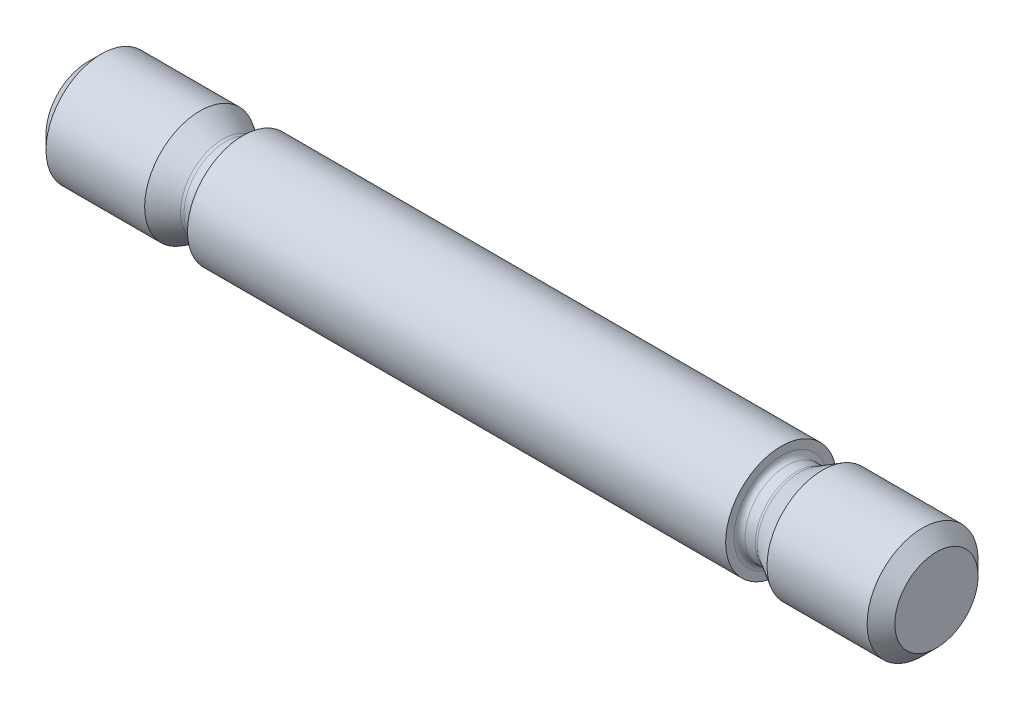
ISO-10303-21;
HEADER;
FILE_DESCRIPTION(('STEP AP214'),'2;1');
FILE_NAME('part.step','',(''),(''),'','','');
FILE_SCHEMA(('AUTOMOTIVE_DESIGN { 1 0 10303 214 1 1 1 1 }'));
ENDSEC;
DATA;
#1=APPLICATION_CONTEXT('core data for automotive mechanical design processes');
#2=APPLICATION_PROTOCOL_DEFINITION('international standard','automotive_design',2000,#1);
#3=PRODUCT_CONTEXT('',#1,'mechanical');
#4=PRODUCT('Part','Part','',(#3));
#5=PRODUCT_RELATED_PRODUCT_CATEGORY('part','',(#4));
#6=PRODUCT_DEFINITION_FORMATION('','',#4);
#7=PRODUCT_DEFINITION_CONTEXT('part definition',#1,'design');
#8=PRODUCT_DEFINITION('design','',#6,#7);
#9=PRODUCT_DEFINITION_SHAPE('','',#8);
#10=(LENGTH_UNIT() NAMED_UNIT(*) SI_UNIT(.MILLI.,.METRE.));
#11=(NAMED_UNIT(*) PLANE_ANGLE_UNIT() SI_UNIT($,.RADIAN.));
#12=(NAMED_UNIT(*) SI_UNIT($,.STERADIAN.) SOLID_ANGLE_UNIT());
#13=UNCERTAINTY_MEASURE_WITH_UNIT(LENGTH_MEASURE(1.E-05),#10,'distance_accuracy_value','');
#14=(GEOMETRIC_REPRESENTATION_CONTEXT(3) GLOBAL_UNCERTAINTY_ASSIGNED_CONTEXT((#13)) GLOBAL_UNIT_ASSIGNED_CONTEXT((#10,
#11,#12)) REPRESENTATION_CONTEXT('',''));
#15=CARTESIAN_POINT('',(0.,0.,0.));
#16=DIRECTION('',(0.,0.,1.));
#17=DIRECTION('',(1.,0.,0.));
#18=AXIS2_PLACEMENT_3D('',#15,#16,#17);
#19=CARTESIAN_POINT('',(0.,6.,0.));
#20=DIRECTION('',(1.,0.,0.));
#21=DIRECTION('',(0.,0.,-1.));
#22=AXIS2_PLACEMENT_3D('',#19,#20,#21);
#23=PLANE('',#22);
#24=CARTESIAN_POINT('',(0.,0.,0.));
#25=DIRECTION('',(-1.,0.,0.));
#26=DIRECTION('',(0.,0.,1.));
#27=AXIS2_PLACEMENT_3D('',#24,#25,#26);
#28=CIRCLE('',#27,6.);
#29=CARTESIAN_POINT('',(0.,0.,6.));
#30=VERTEX_POINT('',#29);
#31=EDGE_CURVE('E83',#30,#30,#28,.T.);
#32=ORIENTED_EDGE('',*,*,#31,.T.);
#33=EDGE_LOOP('',(#32));
#34=FACE_BOUND('',#33,.T.);
#35=ADVANCED_FACE('F31',(#34),#23,.F.);
#36=CARTESIAN_POINT('',(122.4,6.,0.));
#37=DIRECTION('',(1.,0.,0.));
#38=DIRECTION('',(0.,0.,-1.));
#39=AXIS2_PLACEMENT_3D('',#36,#37,#38);
#40=PLANE('',#39);
#41=CARTESIAN_POINT('',(122.4,0.,0.));
#42=DIRECTION('',(-1.,0.,0.));
#43=DIRECTION('',(0.,0.,1.));
#44=AXIS2_PLACEMENT_3D('',#41,#42,#43);
#45=CIRCLE('',#44,6.);
#46=CARTESIAN_POINT('',(122.4,0.,6.));
#47=VERTEX_POINT('',#46);
#48=EDGE_CURVE('E10',#47,#47,#45,.T.);
#49=ORIENTED_EDGE('',*,*,#48,.F.);
#50=EDGE_LOOP('',(#49));
#51=FACE_BOUND('',#50,.T.);
#52=ADVANCED_FACE('F142',(#51),#40,.T.);
#53=CARTESIAN_POINT('',(120.4,0.,0.));
#54=DIRECTION('',(-1.,0.,0.));
#55=DIRECTION('',(0.,0.,1.));
#56=AXIS2_PLACEMENT_3D('',#53,#54,#55);
#57=CONICAL_SURFACE('',#56,8.,0.785398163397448);
#58=ORIENTED_EDGE('',*,*,#48,.T.);
#59=EDGE_LOOP('',(#58));
#60=FACE_BOUND('',#59,.T.);
#61=CARTESIAN_POINT('',(120.4,0.,0.));
#62=DIRECTION('',(-1.,0.,0.));
#63=DIRECTION('',(0.,0.,1.));
#64=AXIS2_PLACEMENT_3D('',#61,#62,#63);
#65=CIRCLE('',#64,8.);
#66=CARTESIAN_POINT('',(120.4,0.,8.));
#67=VERTEX_POINT('',#66);
#68=EDGE_CURVE('E37',#67,#67,#65,.T.);
#69=ORIENTED_EDGE('',*,*,#68,.F.);
#70=EDGE_LOOP('',(#69));
#71=FACE_BOUND('',#70,.T.);
#72=ADVANCED_FACE('F146',(#60,#71),#57,.T.);
#73=CARTESIAN_POINT('',(-3.175,0.,0.));
#74=DIRECTION('',(-1.,0.,0.));
#75=DIRECTION('',(0.,0.,1.));
#76=AXIS2_PLACEMENT_3D('',#73,#74,#75);
#77=CYLINDRICAL_SURFACE('',#76,8.);
#78=ORIENTED_EDGE('',*,*,#68,.T.);
#79=EDGE_LOOP('',(#78));
#80=FACE_BOUND('',#79,.T.);
#81=CARTESIAN_POINT('',(105.964101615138,0.,0.));
#82=DIRECTION('',(-1.,0.,0.));
#83=DIRECTION('',(0.,0.,1.));
#84=AXIS2_PLACEMENT_3D('',#81,#82,#83);
#85=CIRCLE('',#84,8.);
#86=CARTESIAN_POINT('',(105.964101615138,0.,8.));
#87=VERTEX_POINT('',#86);
#88=EDGE_CURVE('E41',#87,#87,#85,.T.);
#89=ORIENTED_EDGE('',*,*,#88,.F.);
#90=EDGE_LOOP('',(#89));
#91=FACE_BOUND('',#90,.T.);
#92=ADVANCED_FACE('F151',(#80,#91),#77,.T.);
#93=CARTESIAN_POINT('',(102.685640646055,0.,0.));
#94=DIRECTION('',(1.,0.,0.));
#95=DIRECTION('',(0.,0.,-1.));
#96=AXIS2_PLACEMENT_3D('',#93,#94,#95);
#97=CONICAL_SURFACE('',#96,6.10717967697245,0.523598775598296);
#98=ORIENTED_EDGE('',*,*,#88,.T.);
#99=EDGE_LOOP('',(#98));
#100=FACE_BOUND('',#99,.T.);
#101=CARTESIAN_POINT('',(102.685640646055,0.,0.));
#102=DIRECTION('',(-1.,0.,0.));
#103=DIRECTION('',(0.,0.,1.));
#104=AXIS2_PLACEMENT_3D('',#101,#102,#103);
#105=CIRCLE('',#104,6.10717967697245);
#106=CARTESIAN_POINT('',(102.685640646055,0.,6.10717967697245));
#107=VERTEX_POINT('',#106);
#108=EDGE_CURVE('E45',#107,#107,#105,.T.);
#109=ORIENTED_EDGE('',*,*,#108,.F.);
#110=EDGE_LOOP('',(#109));
#111=FACE_BOUND('',#110,.T.);
#112=ADVANCED_FACE('F156',(#100,#111),#97,.T.);
#113=CARTESIAN_POINT('',(102.285640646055,0.,0.));
#114=DIRECTION('',(-1.,0.,0.));
#115=DIRECTION('',(0.,0.,1.));
#116=AXIS2_PLACEMENT_3D('',#113,#114,#115);
#117=TOROIDAL_SURFACE('',#116,6.8,0.8);
#118=ORIENTED_EDGE('',*,*,#108,.T.);
#119=EDGE_LOOP('',(#118));
#120=FACE_BOUND('',#119,.T.);
#121=CARTESIAN_POINT('',(102.285640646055,0.,0.));
#122=DIRECTION('',(-1.,0.,0.));
#123=DIRECTION('',(0.,0.,1.));
#124=AXIS2_PLACEMENT_3D('',#121,#122,#123);
#125=CIRCLE('',#124,6.);
#126=CARTESIAN_POINT('',(102.285640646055,0.,6.));
#127=VERTEX_POINT('',#126);
#128=EDGE_CURVE('E50',#127,#127,#125,.T.);
#129=ORIENTED_EDGE('',*,*,#128,.F.);
#130=EDGE_LOOP('',(#129));
#131=FACE_BOUND('',#130,.T.);
#132=ADVANCED_FACE('F159',(#120,#131),#117,.F.);
#133=CARTESIAN_POINT('',(-3.175,0.,0.));
#134=DIRECTION('',(-1.,0.,0.));
#135=DIRECTION('',(0.,0.,1.));
#136=AXIS2_PLACEMENT_3D('',#133,#134,#135);
#137=CYLINDRICAL_SURFACE('',#136,6.);
#138=ORIENTED_EDGE('',*,*,#128,.T.);
#139=EDGE_LOOP('',(#138));
#140=FACE_BOUND('',#139,.T.);
#141=CARTESIAN_POINT('',(100.8,0.,0.));
#142=DIRECTION('',(-1.,0.,0.));
#143=DIRECTION('',(0.,0.,1.));
#144=AXIS2_PLACEMENT_3D('',#141,#142,#143);
#145=CIRCLE('',#144,6.);
#146=CARTESIAN_POINT('',(100.8,0.,6.));
#147=VERTEX_POINT('',#146);
#148=EDGE_CURVE('E53',#147,#147,#145,.T.);
#149=ORIENTED_EDGE('',*,*,#148,.F.);
#150=EDGE_LOOP('',(#149));
#151=FACE_BOUND('',#150,.T.);
#152=ADVANCED_FACE('F163',(#140,#151),#137,.T.);
#153=CARTESIAN_POINT('',(100.8,0.,0.));
#154=DIRECTION('',(-1.,0.,0.));
#155=DIRECTION('',(0.,0.,1.));
#156=AXIS2_PLACEMENT_3D('',#153,#154,#155);
#157=TOROIDAL_SURFACE('',#156,6.8,0.799999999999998);
#158=ORIENTED_EDGE('',*,*,#148,.T.);
#159=EDGE_LOOP('',(#158));
#160=FACE_BOUND('',#159,.T.);
#161=CARTESIAN_POINT('',(100.,0.,0.));
#162=DIRECTION('',(-1.,0.,0.));
#163=DIRECTION('',(0.,0.,1.));
#164=AXIS2_PLACEMENT_3D('',#161,#162,#163);
#165=CIRCLE('',#164,6.8);
#166=CARTESIAN_POINT('',(100.,0.,6.8));
#167=VERTEX_POINT('',#166);
#168=EDGE_CURVE('E56',#167,#167,#165,.T.);
#169=ORIENTED_EDGE('',*,*,#168,.F.);
#170=EDGE_LOOP('',(#169));
#171=FACE_BOUND('',#170,.T.);
#172=ADVANCED_FACE('F138',(#160,#171),#157,.F.);
#173=CARTESIAN_POINT('',(100.,8.,0.));
#174=DIRECTION('',(1.,0.,0.));
#175=DIRECTION('',(0.,0.,-1.));
#176=AXIS2_PLACEMENT_3D('',#173,#174,#175);
#177=PLANE('',#176);
#178=ORIENTED_EDGE('',*,*,#168,.T.);
#179=EDGE_LOOP('',(#178));
#180=FACE_BOUND('',#179,.T.);
#181=CARTESIAN_POINT('',(100.,0.,0.));
#182=DIRECTION('',(-1.,0.,0.));
#183=DIRECTION('',(0.,0.,1.));
#184=AXIS2_PLACEMENT_3D('',#181,#182,#183);
#185=CIRCLE('',#184,8.);
#186=CARTESIAN_POINT('',(100.,0.,8.));
#187=VERTEX_POINT('',#186);
#188=EDGE_CURVE('E59',#187,#187,#185,.T.);
#189=ORIENTED_EDGE('',*,*,#188,.F.);
#190=EDGE_LOOP('',(#189));
#191=FACE_BOUND('',#190,.T.);
#192=ADVANCED_FACE('F132',(#180,#191),#177,.T.);
#193=CARTESIAN_POINT('',(-3.175,0.,0.));
#194=DIRECTION('',(-1.,0.,0.));
#195=DIRECTION('',(0.,0.,1.));
#196=AXIS2_PLACEMENT_3D('',#193,#194,#195);
#197=CYLINDRICAL_SURFACE('',#196,8.);
#198=ORIENTED_EDGE('',*,*,#188,.T.);
#199=EDGE_LOOP('',(#198));
#200=FACE_BOUND('',#199,.T.);
#201=CARTESIAN_POINT('',(22.4,0.,0.));
#202=DIRECTION('',(-1.,0.,0.));
#203=DIRECTION('',(0.,0.,1.));
#204=AXIS2_PLACEMENT_3D('',#201,#202,#203);
#205=CIRCLE('',#204,8.);
#206=CARTESIAN_POINT('',(22.4,0.,8.));
#207=VERTEX_POINT('',#206);
#208=EDGE_CURVE('E62',#207,#207,#205,.T.);
#209=ORIENTED_EDGE('',*,*,#208,.F.);
#210=EDGE_LOOP('',(#209));
#211=FACE_BOUND('',#210,.T.);
#212=ADVANCED_FACE('F127',(#200,#211),#197,.T.);
#213=CARTESIAN_POINT('',(22.4,8.,0.));
#214=DIRECTION('',(1.,0.,0.));
#215=DIRECTION('',(0.,0.,-1.));
#216=AXIS2_PLACEMENT_3D('',#213,#214,#215);
#217=PLANE('',#216);
#218=CARTESIAN_POINT('',(22.4,0.,0.));
#219=DIRECTION('',(-1.,0.,0.));
#220=DIRECTION('',(0.,0.,1.));
#221=AXIS2_PLACEMENT_3D('',#218,#219,#220);
#222=CIRCLE('',#221,6.8);
#223=CARTESIAN_POINT('',(22.4,0.,6.8));
#224=VERTEX_POINT('',#223);
#225=EDGE_CURVE('E65',#224,#224,#222,.T.);
#226=ORIENTED_EDGE('',*,*,#225,.F.);
#227=EDGE_LOOP('',(#226));
#228=FACE_BOUND('',#227,.T.);
#229=ORIENTED_EDGE('',*,*,#208,.T.);
#230=EDGE_LOOP('',(#229));
#231=FACE_BOUND('',#230,.T.);
#232=ADVANCED_FACE('F121',(#228,#231),#217,.F.);
#233=CARTESIAN_POINT('',(21.6,0.,0.));
#234=DIRECTION('',(-1.,0.,0.));
#235=DIRECTION('',(0.,0.,1.));
#236=AXIS2_PLACEMENT_3D('',#233,#234,#235);
#237=TOROIDAL_SURFACE('',#236,6.8,0.799999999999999);
#238=CARTESIAN_POINT('',(21.6,0.,0.));
#239=DIRECTION('',(-1.,0.,0.));
#240=DIRECTION('',(0.,0.,1.));
#241=AXIS2_PLACEMENT_3D('',#238,#239,#240);
#242=CIRCLE('',#241,6.);
#243=CARTESIAN_POINT('',(21.6,0.,6.));
#244=VERTEX_POINT('',#243);
#245=EDGE_CURVE('E68',#244,#244,#242,.T.);
#246=ORIENTED_EDGE('',*,*,#245,.F.);
#247=EDGE_LOOP('',(#246));
#248=FACE_BOUND('',#247,.T.);
#249=ORIENTED_EDGE('',*,*,#225,.T.);
#250=EDGE_LOOP('',(#249));
#251=FACE_BOUND('',#250,.T.);
#252=ADVANCED_FACE('F115',(#248,#251),#237,.F.);
#253=CARTESIAN_POINT('',(-3.175,0.,0.));
#254=DIRECTION('',(-1.,0.,0.));
#255=DIRECTION('',(0.,0.,1.));
#256=AXIS2_PLACEMENT_3D('',#253,#254,#255);
#257=CYLINDRICAL_SURFACE('',#256,6.);
#258=CARTESIAN_POINT('',(19.9,0.,0.));
#259=DIRECTION('',(-1.,0.,0.));
#260=DIRECTION('',(0.,0.,1.));
#261=AXIS2_PLACEMENT_3D('',#258,#259,#260);
#262=CIRCLE('',#261,6.);
#263=CARTESIAN_POINT('',(19.9,0.,6.));
#264=VERTEX_POINT('',#263);
#265=EDGE_CURVE('E71',#264,#264,#262,.T.);
#266=ORIENTED_EDGE('',*,*,#265,.F.);
#267=EDGE_LOOP('',(#266));
#268=FACE_BOUND('',#267,.T.);
#269=ORIENTED_EDGE('',*,*,#245,.T.);
#270=EDGE_LOOP('',(#269));
#271=FACE_BOUND('',#270,.T.);
#272=ADVANCED_FACE('F109',(#268,#271),#257,.T.);
#273=CARTESIAN_POINT('',(19.9,0.,0.));
#274=DIRECTION('',(-1.,0.,0.));
#275=DIRECTION('',(0.,0.,1.));
#276=AXIS2_PLACEMENT_3D('',#273,#274,#275);
#277=TOROIDAL_SURFACE('',#276,6.8,0.8);
#278=CARTESIAN_POINT('',(19.5,0.,0.));
#279=DIRECTION('',(-1.,0.,0.));
#280=DIRECTION('',(0.,0.,1.));
#281=AXIS2_PLACEMENT_3D('',#278,#279,#280);
#282=CIRCLE('',#281,6.10717967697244);
#283=CARTESIAN_POINT('',(19.5,0.,6.10717967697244));
#284=VERTEX_POINT('',#283);
#285=EDGE_CURVE('E74',#284,#284,#282,.T.);
#286=ORIENTED_EDGE('',*,*,#285,.F.);
#287=EDGE_LOOP('',(#286));
#288=FACE_BOUND('',#287,.T.);
#289=ORIENTED_EDGE('',*,*,#265,.T.);
#290=EDGE_LOOP('',(#289));
#291=FACE_BOUND('',#290,.T.);
#292=ADVANCED_FACE('F103',(#288,#291),#277,.F.);
#293=CARTESIAN_POINT('',(19.5,0.,0.));
#294=DIRECTION('',(-1.,0.,0.));
#295=DIRECTION('',(0.,0.,1.));
#296=AXIS2_PLACEMENT_3D('',#293,#294,#295);
#297=CONICAL_SURFACE('',#296,6.10717967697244,0.523598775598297);
#298=CARTESIAN_POINT('',(16.2215390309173,0.,0.));
#299=DIRECTION('',(-1.,0.,0.));
#300=DIRECTION('',(0.,0.,1.));
#301=AXIS2_PLACEMENT_3D('',#298,#299,#300);
#302=CIRCLE('',#301,8.);
#303=CARTESIAN_POINT('',(16.2215390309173,0.,8.));
#304=VERTEX_POINT('',#303);
#305=EDGE_CURVE('E77',#304,#304,#302,.T.);
#306=ORIENTED_EDGE('',*,*,#305,.F.);
#307=EDGE_LOOP('',(#306));
#308=FACE_BOUND('',#307,.T.);
#309=ORIENTED_EDGE('',*,*,#285,.T.);
#310=EDGE_LOOP('',(#309));
#311=FACE_BOUND('',#310,.T.);
#312=ADVANCED_FACE('F97',(#308,#311),#297,.T.);
#313=CARTESIAN_POINT('',(-3.175,0.,0.));
#314=DIRECTION('',(-1.,0.,0.));
#315=DIRECTION('',(0.,0.,1.));
#316=AXIS2_PLACEMENT_3D('',#313,#314,#315);
#317=CYLINDRICAL_SURFACE('',#316,8.);
#318=CARTESIAN_POINT('',(1.99999999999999,0.,0.));
#319=DIRECTION('',(-1.,0.,0.));
#320=DIRECTION('',(0.,0.,1.));
#321=AXIS2_PLACEMENT_3D('',#318,#319,#320);
#322=CIRCLE('',#321,8.);
#323=CARTESIAN_POINT('',(1.99999999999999,0.,8.));
#324=VERTEX_POINT('',#323);
#325=EDGE_CURVE('E80',#324,#324,#322,.T.);
#326=ORIENTED_EDGE('',*,*,#325,.F.);
#327=EDGE_LOOP('',(#326));
#328=FACE_BOUND('',#327,.T.);
#329=ORIENTED_EDGE('',*,*,#305,.T.);
#330=EDGE_LOOP('',(#329));
#331=FACE_BOUND('',#330,.T.);
#332=ADVANCED_FACE('F91',(#328,#331),#317,.T.);
#333=CARTESIAN_POINT('',(1.99999999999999,0.,0.));
#334=DIRECTION('',(1.,0.,0.));
#335=DIRECTION('',(0.,0.,-1.));
#336=AXIS2_PLACEMENT_3D('',#333,#334,#335);
#337=CONICAL_SURFACE('',#336,8.,0.78539816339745);
#338=ORIENTED_EDGE('',*,*,#31,.F.);
#339=EDGE_LOOP('',(#338));
#340=FACE_BOUND('',#339,.T.);
#341=ORIENTED_EDGE('',*,*,#325,.T.);
#342=EDGE_LOOP('',(#341));
#343=FACE_BOUND('',#342,.T.);
#344=ADVANCED_FACE('F88',(#340,#343),#337,.T.);
#345=CLOSED_SHELL('',(#35,#52,#72,#92,#112,#132,#152,#172,#192,#212,#232,#252,#272,#292,#312,
#332,#344));
#346=MANIFOLD_SOLID_BREP('B2',#345);
#347=ADVANCED_BREP_SHAPE_REPRESENTATION('',(#18,#346),#14);
#348=SHAPE_DEFINITION_REPRESENTATION(#9,#347);
ENDSEC;
END-ISO-10303-21;
